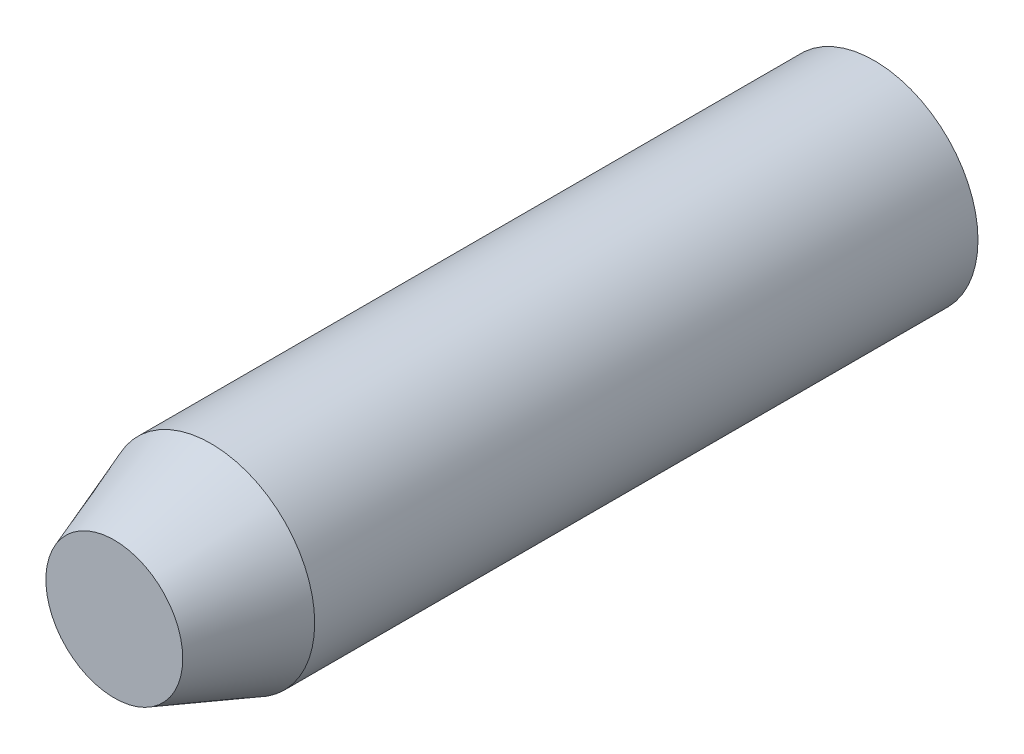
from build123d import *

# Parameters (mm, degrees)
ESQUISSE1_R        = 1.5
BOSS_EXTRU_1_DEPTH = 11
CHANFREIN1_SIZE    = 1.4
CHANFREIN1_SIZE2   = 0.509558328


with BuildPart() as part:
    # Esquisse1 → Boss.-Extru.1 (new body)
    with BuildSketch(Plane.XY):
        Circle(ESQUISSE1_R)
    extrude(amount=BOSS_EXTRU_1_DEPTH)

    # Chanfrein1
    chanfrein1_edges = [part.edges().sort_by_distance(p)[0] for p in [
        (-1.5, 0, 11),
    ]]
    chanfrein1_side = [part.faces().sort_by_distance(p)[0] for p in [
        (-1.5, 0, 5.5),
    ]]
    chamfer(chanfrein1_edges, length=CHANFREIN1_SIZE, length2=CHANFREIN1_SIZE2, reference=chanfrein1_side[0])


solid = part.part
